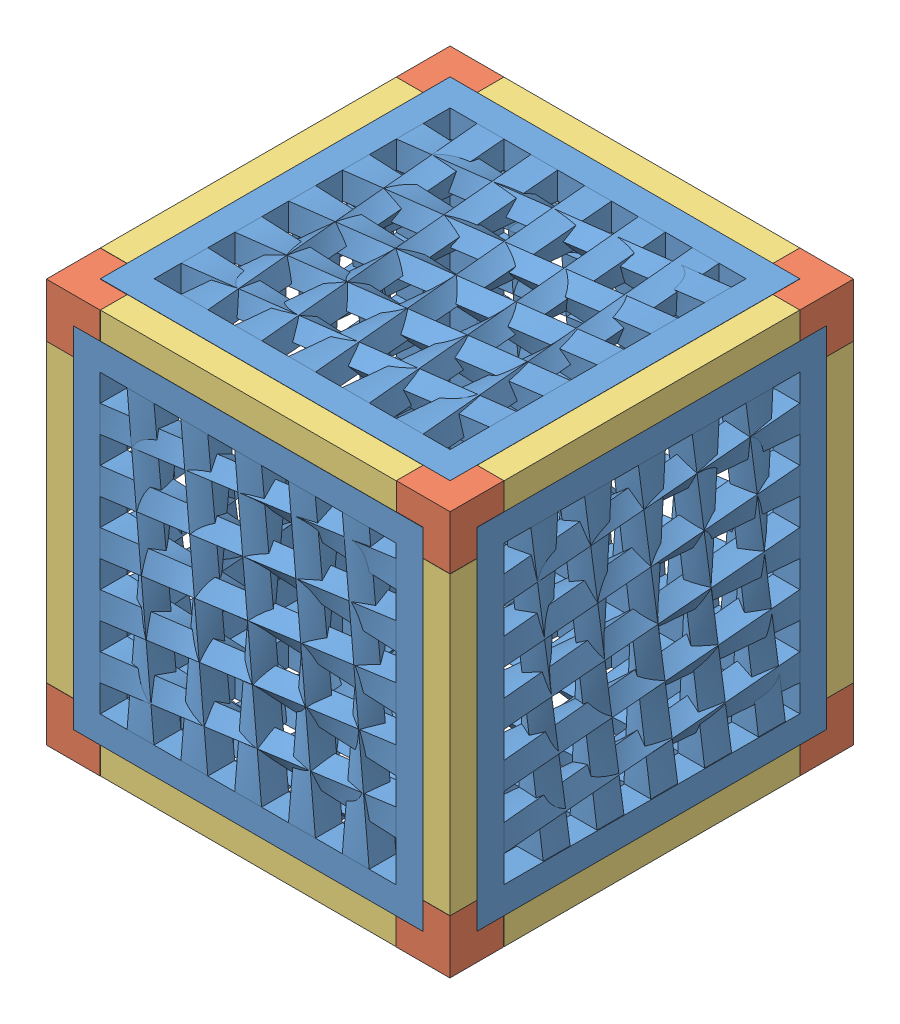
SolidWorks assembly Assem1.sldasm, configuration Default (file format 9000). Lengths in mm.
Overall size (75.71 75.71 75.75).
26 component instances, 3 part files, 32 mates.
Components (placement in the parent):
- week5-1: week5.SLDPRT [Default] at (-8.4945 6.6449 62.5175) size (65 65 5.71)
- week5_tris-1: week5_tris.SLDPRT [Default] at (-40.9945 -28.3551 62.5175) size (10 10 10)
- week5_bis-4: week5_bis.SLDPRT [Default] at (-35.9945 -28.3551 65.0175) x (0 0 -1) z (1 0 0) size (5 5 55)
- week5_bis-5: week5_bis.SLDPRT [Default] at (-43.4945 -20.8551 65.0175) x (0 0 -1) z (0 1 0) size (5 5 55)
- week5_bis-6: week5_bis.SLDPRT [Default] at (-35.9945 41.6449 65.0175) x (0 0 -1) z (1 0 0) size (5 5 55)
- week5_bis-7: week5_bis.SLDPRT [Default] at (26.5055 -20.8551 65.0175) x (0 0 -1) z (0 1 0) size (5 5 55)
- week5_tris-3: week5_tris.SLDPRT [Default] at (26.5055 -25.8551 62.5175) x (0 1 0) z (0 0 1) size (10 10 10)
- week5_tris-4: week5_tris.SLDPRT [Default] at (-43.4945 39.1449 62.5175) x (0 -1 0) z (0 0 1) size (10 10 10)
- week5-6: week5.SLDPRT [Default] at (-8.4945 -25.8551 100.0175) x (1 0 0) z (0 -1 0) size (65 65 5.71)
- week5-7: week5.SLDPRT [Default] at (-45.9945 6.6449 100.0175) x (0 -1 0) z (1 0 0) size (65 65 5.71)
- week5_tris-17: week5_tris.SLDPRT [Default] at (29.0055 39.1449 65.0175) x (0 -1 0) z (-1 0 0) size (10 10 10)
- week5_bis-23: week5_bis.SLDPRT [Default] at (-43.4945 -28.3551 72.5175) size (5 5 55)
- week5-8: week5.SLDPRT [Default] at (-8.4945 39.1798 100.0175) x (1 0 0) z (0 1 0) size (65 65 5.71)
- week5-9: week5.SLDPRT [Default] at (24.0055 6.6449 100.0175) x (0 -1 0) z (1 0 0) size (65 65 5.71)
- week5_bis-24: week5_bis.SLDPRT [Default] at (26.5055 41.6449 127.5175) x (0 -1 0) z (0 0 -1) size (5 5 55)
- week5_bis-25: week5_bis.SLDPRT [Default] at (-43.4945 41.6449 72.5175) size (5 5 55)
- week5_bis-26: week5_bis.SLDPRT [Default] at (26.5055 -28.3551 72.5175) size (5 5 55)
- week5_bis-27: week5_bis.SLDPRT [Default] at (19.0055 41.6449 135.0175) x (0 0 1) z (-1 0 0) size (5 5 55)
- week5_bis-28: week5_bis.SLDPRT [Default] at (-43.4945 34.1449 135.0175) x (0 0 1) z (0 -1 0) size (5 5 55)
- week5_bis-29: week5_bis.SLDPRT [Default] at (19.0055 -28.3551 135.0175) x (0 0 1) z (-1 0 0) size (5 5 55)
- week5_bis-30: week5_bis.SLDPRT [Default] at (26.5055 34.1449 135.0175) x (0 0 1) z (0 -1 0) size (5 5 55)
- week5-10: week5.SLDPRT [Default] at (-8.4945 6.6449 132.5524) size (65 65 5.71)
- week5_tris-21: week5_tris.SLDPRT [Default] at (-45.9945 -28.3551 132.5524) x (0 0 -1) z (1 0 0) size (10 10 10)
- week5_tris-22: week5_tris.SLDPRT [Default] at (-45.9945 39.1449 135.0524) x (0 -1 0) z (1 0 0) size (10 10 10)
- week5_tris-23: week5_tris.SLDPRT [Default] at (29.0055 -25.8551 135.0524) x (0 1 0) z (-1 0 0) size (10 10 10)
- week5_tris-24: week5_tris.SLDPRT [Default] at (26.5055 39.1798 137.5175) x (0 -1 0) z (0 0 -1) size (10 10 10)
Mates (geometry in assembly coordinates):
- Coincident15: coincident aligned: line of week5-1 through (-40.9945 -25.8551 67.5175) axis (0 0 -1); line of week5_tris-1 through (-40.9945 -25.8551 67.5175) axis (0 0 -1)
- Coincident16: coincident anti-aligned: line of week5-1 through (-40.9945 39.1449 62.5175) axis (0 -1 0); line of week5_tris-1 through (-40.9945 -25.8551 62.5175) axis (0 1 0)
- Coincident17: coincident anti-aligned: line of week5_tris-1 through (-35.9945 -25.8551 67.5175) axis (0 0 -1); line of week5_bis-4 through (-35.9945 -25.8551 62.5175) axis (0 0 1)
- Coincident18: coincident anti-aligned: line of week5-1 through (-40.9945 -25.8551 62.5175) axis (1 0 0); line of week5_bis-4 through (19.0055 -25.8551 62.5175) axis (-1 0 0)
- Coincident19: coincident aligned: line of week5_tris-1 through (-40.9945 -20.8551 67.5175) axis (0 0 -1); line of week5_bis-5 through (-40.9945 -20.8551 67.5175) axis (0 0 -1)
- Coincident20: coincident aligned: line of week5-1 through (-40.9945 39.1449 62.5175) axis (0 -1 0); line of week5_bis-5 through (-40.9945 34.1449 62.5175) axis (0 -1 0)
- Coincident21: coincident aligned: line of week5-1 through (24.0055 -25.8551 67.5175) axis (0 0 -1); line of week5_tris-3 through (24.0055 -25.8551 67.5175) axis (0 0 -1)
- Coincident22: coincident anti-aligned: line of week5-1 through (24.0055 -25.8551 67.5175) axis (0 1 0); line of week5_tris-3 through (24.0055 -20.8551 67.5175) axis (0 -1 0)
- Coincident23: coincident aligned: line of week5-1 through (-40.9945 39.1449 67.5175) axis (0 0 -1); line of week5_tris-4 through (-40.9945 39.1449 67.5175) axis (0 0 -1)
- Coincident24: coincident anti-aligned: line of week5-1 through (24.0055 39.1449 67.5175) axis (-1 0 0); line of week5_tris-4 through (-40.9945 39.1449 67.5175) axis (1 0 0)
- Coincident41: coincident aligned: line of ? through (-51.5162 -169.6565 216.7609) axis (0 0 -1); line of ? through (-51.5162 -169.6565 216.7609) axis (0 0 -1)
- Coincident43: coincident anti-aligned: line of ? through (8.4838 -174.6565 211.7609) axis (-1 0 0); line of ? through (-51.5162 -174.6565 211.7609) axis (1 0 0)
- Coincident45: coincident aligned: line of ? through (-51.5162 -109.6565 216.7609) axis (0 0 -1); line of ? through (-51.5162 -109.6565 216.7609) axis (0 0 -1)
- Coincident46: coincident anti-aligned: line of ? through (-51.5162 -109.6565 216.7609) axis (1 0 0); line of ? through (13.4838 -109.6565 216.7609) axis (-1 0 0)
- Coincident47: coincident aligned: line of ? through (-51.5162 -114.6565 211.7609) axis (0 -1 0); line of ? through (-51.5162 -109.6565 211.7609) axis (0 -1 0)
- Coincident48: coincident aligned: line of ? through (-51.5162 -174.6565 216.7609) axis (0 0 -1); line of ? through (-51.5162 -174.6565 216.7609) axis (0 0 -1)
- Coincident49: coincident anti-aligned: line of ? through (-51.5162 -174.6565 211.7609) axis (0 1 0); line of ? through (-51.5162 -109.6565 211.7609) axis (0 -1 0)
- Coincident50: coincident anti-aligned: line of ? through (-46.5162 -174.6565 216.7609) axis (0 0 -1); line of ? through (-46.5162 -174.6565 211.7609) axis (0 0 1)
- Coincident65: coincident anti-aligned: line of week5_bis-4 through (19.0055 -30.8551 67.5175) axis (-1 0 0); line of week5-6 through (-40.9945 -30.8551 67.5175) axis (1 0 0)
- Coincident66: coincident: point of week5_tris-1; point of week5-6
- Coincident67: coincident aligned: line of week5-6 through (-40.9945 -25.8551 132.5175) axis (0 0 -1); line of week5-7 through (-40.9945 -25.8551 132.5175) axis (0 0 -1)
- Coincident69: coincident anti-aligned: plane of week5_bis-5 through (-40.9945 34.1449 67.5175) normal (0 0 1); plane of week5-7 through (-40.9945 39.1449 67.5175) normal (0 0 -1)
- Coincident71: coincident: line of week5-1 through (-40.9945 39.1449 67.5175) axis (0 -1 0); point of week5-7
- Coincident74: coincident anti-aligned: line of week5-1 through (24.0055 39.1449 67.5175) axis (0 0 -1); line of week5_tris-17 through (24.0055 39.1449 62.5175) axis (0 0 1)
- Coincident75: coincident: point of week5-1; point of week5_tris-17
- Coincident76: coincident: point of week5_tris-1; point of week5_bis-23
- Coincident77: coincident: point of week5_tris-4; point of week5_bis-25
- Coincident78: coincident: point of week5_tris-3; point of week5_bis-26
- Coincident79: coincident: point of week5-10; point of week5_tris-21
- Coincident80: coincident: point of week5-10; point of week5_tris-22
- Coincident81: coincident: point of week5-10; point of week5_tris-23
- Coincident82: coincident: point of week5-8; point of week5_tris-24
